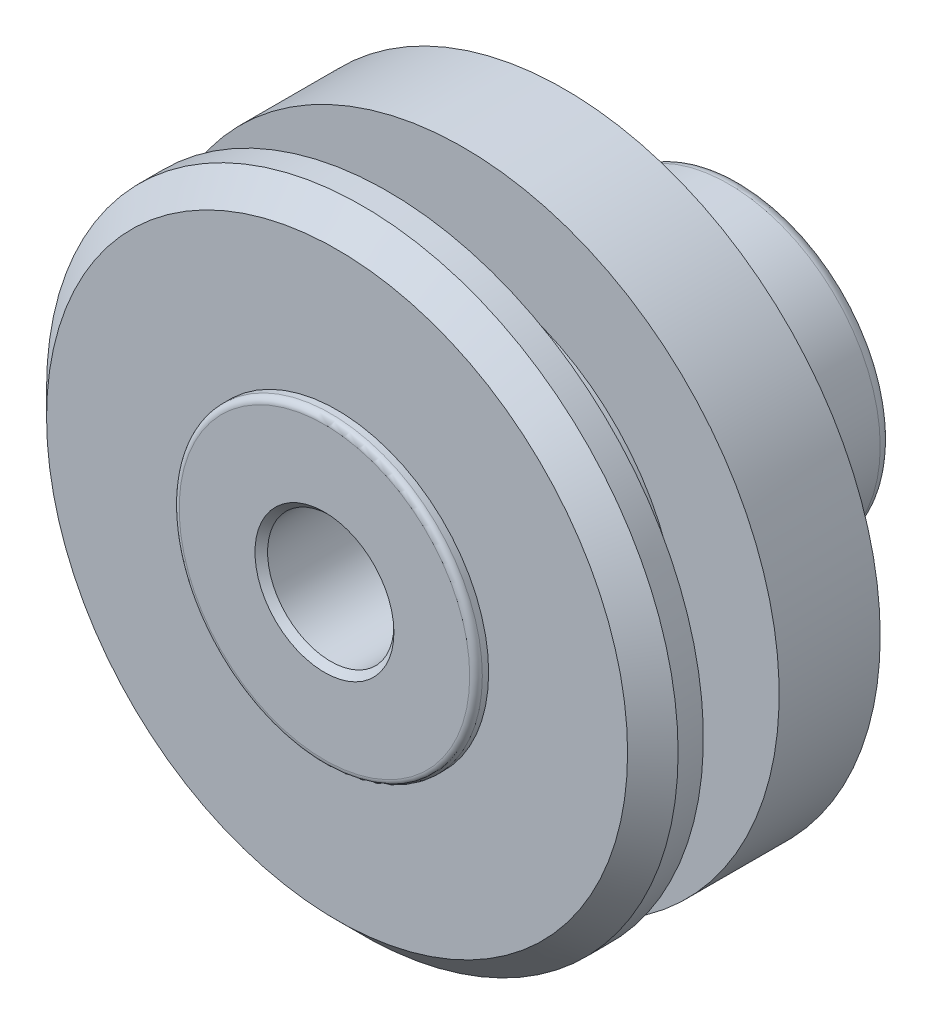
ISO-10303-21;
HEADER;
FILE_DESCRIPTION(('STEP AP214'),'2;1');
FILE_NAME('part.step','',(''),(''),'','','');
FILE_SCHEMA(('AUTOMOTIVE_DESIGN { 1 0 10303 214 1 1 1 1 }'));
ENDSEC;
DATA;
#1=APPLICATION_CONTEXT('core data for automotive mechanical design processes');
#2=APPLICATION_PROTOCOL_DEFINITION('international standard','automotive_design',2000,#1);
#3=PRODUCT_CONTEXT('',#1,'mechanical');
#4=PRODUCT('Part','Part','',(#3));
#5=PRODUCT_RELATED_PRODUCT_CATEGORY('part','',(#4));
#6=PRODUCT_DEFINITION_FORMATION('','',#4);
#7=PRODUCT_DEFINITION_CONTEXT('part definition',#1,'design');
#8=PRODUCT_DEFINITION('design','',#6,#7);
#9=PRODUCT_DEFINITION_SHAPE('','',#8);
#10=(LENGTH_UNIT() NAMED_UNIT(*) SI_UNIT(.MILLI.,.METRE.));
#11=(NAMED_UNIT(*) PLANE_ANGLE_UNIT() SI_UNIT($,.RADIAN.));
#12=(NAMED_UNIT(*) SI_UNIT($,.STERADIAN.) SOLID_ANGLE_UNIT());
#13=UNCERTAINTY_MEASURE_WITH_UNIT(LENGTH_MEASURE(1.E-05),#10,'distance_accuracy_value','');
#14=(GEOMETRIC_REPRESENTATION_CONTEXT(3) GLOBAL_UNCERTAINTY_ASSIGNED_CONTEXT((#13)) GLOBAL_UNIT_ASSIGNED_CONTEXT((#10,
#11,#12)) REPRESENTATION_CONTEXT('',''));
#15=CARTESIAN_POINT('',(0.,0.,0.));
#16=DIRECTION('',(0.,0.,1.));
#17=DIRECTION('',(1.,0.,0.));
#18=AXIS2_PLACEMENT_3D('',#15,#16,#17);
#19=CARTESIAN_POINT('',(0.,0.,9.00000000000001));
#20=DIRECTION('',(0.,0.,1.));
#21=DIRECTION('',(1.,0.,0.));
#22=AXIS2_PLACEMENT_3D('',#19,#20,#21);
#23=PLANE('',#22);
#24=CARTESIAN_POINT('',(0.,0.,9.00000000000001));
#25=DIRECTION('',(0.,0.,1.));
#26=DIRECTION('',(1.,0.,0.));
#27=AXIS2_PLACEMENT_3D('',#24,#25,#26);
#28=CIRCLE('',#27,11.5);
#29=CARTESIAN_POINT('',(11.5,0.,9.00000000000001));
#30=VERTEX_POINT('',#29);
#31=EDGE_CURVE('E55',#30,#30,#28,.T.);
#32=ORIENTED_EDGE('',*,*,#31,.T.);
#33=EDGE_LOOP('',(#32));
#34=FACE_BOUND('',#33,.T.);
#35=CARTESIAN_POINT('',(0.,0.,9.00000000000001));
#36=DIRECTION('',(0.,0.,1.));
#37=DIRECTION('',(1.,0.,0.));
#38=AXIS2_PLACEMENT_3D('',#35,#36,#37);
#39=CIRCLE('',#38,6.);
#40=CARTESIAN_POINT('',(6.,0.,9.00000000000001));
#41=VERTEX_POINT('',#40);
#42=EDGE_CURVE('E73',#41,#41,#39,.T.);
#43=ORIENTED_EDGE('',*,*,#42,.F.);
#44=EDGE_LOOP('',(#43));
#45=FACE_BOUND('',#44,.T.);
#46=ADVANCED_FACE('F26',(#34,#45),#23,.T.);
#47=CARTESIAN_POINT('',(0.,0.,9.00000000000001));
#48=DIRECTION('',(0.,0.,-1.));
#49=DIRECTION('',(-1.,0.,0.));
#50=AXIS2_PLACEMENT_3D('',#47,#48,#49);
#51=CYLINDRICAL_SURFACE('',#50,12.5);
#52=CARTESIAN_POINT('',(0.,0.,8.00000000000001));
#53=DIRECTION('',(0.,0.,1.));
#54=DIRECTION('',(1.,0.,0.));
#55=AXIS2_PLACEMENT_3D('',#52,#53,#54);
#56=CIRCLE('',#55,12.5);
#57=CARTESIAN_POINT('',(12.5,0.,8.00000000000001));
#58=VERTEX_POINT('',#57);
#59=EDGE_CURVE('E52',#58,#58,#56,.F.);
#60=ORIENTED_EDGE('',*,*,#59,.T.);
#61=EDGE_LOOP('',(#60));
#62=FACE_BOUND('',#61,.T.);
#63=CARTESIAN_POINT('',(0.,0.,7.00000000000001));
#64=DIRECTION('',(0.,0.,-1.));
#65=DIRECTION('',(-1.,0.,0.));
#66=AXIS2_PLACEMENT_3D('',#63,#64,#65);
#67=CIRCLE('',#66,12.5);
#68=CARTESIAN_POINT('',(-12.5,0.,7.00000000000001));
#69=VERTEX_POINT('',#68);
#70=EDGE_CURVE('E61',#69,#69,#67,.T.);
#71=ORIENTED_EDGE('',*,*,#70,.F.);
#72=EDGE_LOOP('',(#71));
#73=FACE_BOUND('',#72,.T.);
#74=ADVANCED_FACE('F28',(#62,#73),#51,.T.);
#75=CARTESIAN_POINT('',(0.,0.,9.00000000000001));
#76=DIRECTION('',(0.,0.,-1.));
#77=DIRECTION('',(-1.,0.,0.));
#78=AXIS2_PLACEMENT_3D('',#75,#76,#77);
#79=CONICAL_SURFACE('',#78,11.5,0.785398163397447);
#80=ORIENTED_EDGE('',*,*,#59,.F.);
#81=EDGE_LOOP('',(#80));
#82=FACE_BOUND('',#81,.T.);
#83=ORIENTED_EDGE('',*,*,#31,.F.);
#84=EDGE_LOOP('',(#83));
#85=FACE_BOUND('',#84,.T.);
#86=ADVANCED_FACE('F138',(#82,#85),#79,.T.);
#87=CARTESIAN_POINT('',(12.5,0.,7.00000000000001));
#88=DIRECTION('',(0.,0.,-1.));
#89=DIRECTION('',(-1.,0.,0.));
#90=AXIS2_PLACEMENT_3D('',#87,#88,#89);
#91=PLANE('',#90);
#92=ORIENTED_EDGE('',*,*,#70,.T.);
#93=EDGE_LOOP('',(#92));
#94=FACE_BOUND('',#93,.T.);
#95=CARTESIAN_POINT('',(0.,0.,7.00000000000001));
#96=DIRECTION('',(0.,0.,-1.));
#97=DIRECTION('',(-1.,0.,0.));
#98=AXIS2_PLACEMENT_3D('',#95,#96,#97);
#99=CIRCLE('',#98,8.5);
#100=CARTESIAN_POINT('',(-8.5,0.,7.00000000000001));
#101=VERTEX_POINT('',#100);
#102=EDGE_CURVE('E64',#101,#101,#99,.T.);
#103=ORIENTED_EDGE('',*,*,#102,.F.);
#104=EDGE_LOOP('',(#103));
#105=FACE_BOUND('',#104,.T.);
#106=ADVANCED_FACE('F150',(#94,#105),#91,.T.);
#107=CARTESIAN_POINT('',(0.,0.,-4.45904436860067));
#108=DIRECTION('',(0.,0.,-1.));
#109=DIRECTION('',(-1.,0.,0.));
#110=AXIS2_PLACEMENT_3D('',#107,#108,#109);
#111=CYLINDRICAL_SURFACE('',#110,8.5);
#112=ORIENTED_EDGE('',*,*,#102,.T.);
#113=EDGE_LOOP('',(#112));
#114=FACE_BOUND('',#113,.T.);
#115=CARTESIAN_POINT('',(0.,0.,4.));
#116=DIRECTION('',(0.,0.,-1.));
#117=DIRECTION('',(-1.,0.,0.));
#118=AXIS2_PLACEMENT_3D('',#115,#116,#117);
#119=CIRCLE('',#118,8.5);
#120=CARTESIAN_POINT('',(-8.5,0.,4.));
#121=VERTEX_POINT('',#120);
#122=EDGE_CURVE('E67',#121,#121,#119,.T.);
#123=ORIENTED_EDGE('',*,*,#122,.F.);
#124=EDGE_LOOP('',(#123));
#125=FACE_BOUND('',#124,.T.);
#126=ADVANCED_FACE('F154',(#114,#125),#111,.T.);
#127=CARTESIAN_POINT('',(12.5,0.,4.));
#128=DIRECTION('',(0.,0.,1.));
#129=DIRECTION('',(1.,0.,0.));
#130=AXIS2_PLACEMENT_3D('',#127,#128,#129);
#131=PLANE('',#130);
#132=ORIENTED_EDGE('',*,*,#122,.T.);
#133=EDGE_LOOP('',(#132));
#134=FACE_BOUND('',#133,.T.);
#135=CARTESIAN_POINT('',(0.,0.,4.));
#136=DIRECTION('',(0.,0.,-1.));
#137=DIRECTION('',(-1.,0.,0.));
#138=AXIS2_PLACEMENT_3D('',#135,#136,#137);
#139=CIRCLE('',#138,12.5);
#140=CARTESIAN_POINT('',(-12.5,0.,4.));
#141=VERTEX_POINT('',#140);
#142=EDGE_CURVE('E70',#141,#141,#139,.T.);
#143=ORIENTED_EDGE('',*,*,#142,.F.);
#144=EDGE_LOOP('',(#143));
#145=FACE_BOUND('',#144,.T.);
#146=ADVANCED_FACE('F146',(#134,#145),#131,.T.);
#147=CARTESIAN_POINT('',(0.,0.,0.));
#148=DIRECTION('',(0.,0.,1.));
#149=DIRECTION('',(1.,0.,0.));
#150=AXIS2_PLACEMENT_3D('',#147,#148,#149);
#151=PLANE('',#150);
#152=CARTESIAN_POINT('',(0.,0.,0.));
#153=DIRECTION('',(0.,0.,-1.));
#154=DIRECTION('',(-1.,0.,0.));
#155=AXIS2_PLACEMENT_3D('',#152,#153,#154);
#156=CIRCLE('',#155,9.5);
#157=CARTESIAN_POINT('',(-9.5,0.,0.));
#158=VERTEX_POINT('',#157);
#159=EDGE_CURVE('E82',#158,#158,#156,.T.);
#160=ORIENTED_EDGE('',*,*,#159,.F.);
#161=EDGE_LOOP('',(#160));
#162=FACE_BOUND('',#161,.T.);
#163=CARTESIAN_POINT('',(0.,0.,0.));
#164=DIRECTION('',(0.,0.,1.));
#165=DIRECTION('',(1.,0.,0.));
#166=AXIS2_PLACEMENT_3D('',#163,#164,#165);
#167=CIRCLE('',#166,12.5);
#168=CARTESIAN_POINT('',(12.5,0.,0.));
#169=VERTEX_POINT('',#168);
#170=EDGE_CURVE('E58',#169,#169,#167,.T.);
#171=ORIENTED_EDGE('',*,*,#170,.F.);
#172=EDGE_LOOP('',(#171));
#173=FACE_BOUND('',#172,.T.);
#174=ADVANCED_FACE('F143',(#162,#173),#151,.F.);
#175=ORIENTED_EDGE('',*,*,#170,.T.);
#176=EDGE_LOOP('',(#175));
#177=FACE_BOUND('',#176,.T.);
#178=ORIENTED_EDGE('',*,*,#142,.T.);
#179=EDGE_LOOP('',(#178));
#180=FACE_BOUND('',#179,.T.);
#181=ADVANCED_FACE('F140',(#177,#180),#51,.T.);
#182=CARTESIAN_POINT('',(0.,0.,9.50000000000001));
#183=DIRECTION('',(0.,0.,-1.));
#184=DIRECTION('',(-1.,0.,0.));
#185=AXIS2_PLACEMENT_3D('',#182,#183,#184);
#186=CYLINDRICAL_SURFACE('',#185,6.);
#187=CARTESIAN_POINT('',(0.,0.,9.25000000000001));
#188=DIRECTION('',(0.,0.,1.));
#189=DIRECTION('',(1.,0.,0.));
#190=AXIS2_PLACEMENT_3D('',#187,#188,#189);
#191=CIRCLE('',#190,6.);
#192=CARTESIAN_POINT('',(6.,0.,9.25000000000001));
#193=VERTEX_POINT('',#192);
#194=EDGE_CURVE('E46',#193,#193,#191,.F.);
#195=ORIENTED_EDGE('',*,*,#194,.T.);
#196=EDGE_LOOP('',(#195));
#197=FACE_BOUND('',#196,.T.);
#198=ORIENTED_EDGE('',*,*,#42,.T.);
#199=EDGE_LOOP('',(#198));
#200=FACE_BOUND('',#199,.T.);
#201=ADVANCED_FACE('F162',(#197,#200),#186,.T.);
#202=CARTESIAN_POINT('',(0.,0.,9.50000000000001));
#203=DIRECTION('',(0.,0.,1.));
#204=DIRECTION('',(1.,0.,0.));
#205=AXIS2_PLACEMENT_3D('',#202,#203,#204);
#206=PLANE('',#205);
#207=CARTESIAN_POINT('',(0.,0.,9.50000000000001));
#208=DIRECTION('',(0.,0.,1.));
#209=DIRECTION('',(1.,0.,0.));
#210=AXIS2_PLACEMENT_3D('',#207,#208,#209);
#211=CIRCLE('',#210,2.75);
#212=CARTESIAN_POINT('',(2.75,0.,9.50000000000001));
#213=VERTEX_POINT('',#212);
#214=EDGE_CURVE('E10',#213,#213,#211,.F.);
#215=ORIENTED_EDGE('',*,*,#214,.T.);
#216=EDGE_LOOP('',(#215));
#217=FACE_BOUND('',#216,.T.);
#218=CARTESIAN_POINT('',(0.,0.,9.50000000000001));
#219=DIRECTION('',(0.,0.,1.));
#220=DIRECTION('',(1.,0.,0.));
#221=AXIS2_PLACEMENT_3D('',#218,#219,#220);
#222=CIRCLE('',#221,5.75);
#223=CARTESIAN_POINT('',(5.75,0.,9.50000000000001));
#224=VERTEX_POINT('',#223);
#225=EDGE_CURVE('E49',#224,#224,#222,.T.);
#226=ORIENTED_EDGE('',*,*,#225,.T.);
#227=EDGE_LOOP('',(#226));
#228=FACE_BOUND('',#227,.T.);
#229=ADVANCED_FACE('F165',(#217,#228),#206,.T.);
#230=CARTESIAN_POINT('',(0.,0.,9.25000000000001));
#231=DIRECTION('',(0.,0.,1.));
#232=DIRECTION('',(1.,0.,0.));
#233=AXIS2_PLACEMENT_3D('',#230,#231,#232);
#234=TOROIDAL_SURFACE('',#233,5.75,0.25);
#235=ORIENTED_EDGE('',*,*,#194,.F.);
#236=EDGE_LOOP('',(#235));
#237=FACE_BOUND('',#236,.T.);
#238=ORIENTED_EDGE('',*,*,#225,.F.);
#239=EDGE_LOOP('',(#238));
#240=FACE_BOUND('',#239,.T.);
#241=ADVANCED_FACE('F169',(#237,#240),#234,.T.);
#242=CARTESIAN_POINT('',(0.,0.,2.5));
#243=DIRECTION('',(0.,0.,1.));
#244=DIRECTION('',(1.,0.,0.));
#245=AXIS2_PLACEMENT_3D('',#242,#243,#244);
#246=CYLINDRICAL_SURFACE('',#245,2.5);
#247=CARTESIAN_POINT('',(0.,0.,9.25000000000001));
#248=DIRECTION('',(0.,0.,1.));
#249=DIRECTION('',(1.,0.,0.));
#250=AXIS2_PLACEMENT_3D('',#247,#248,#249);
#251=CIRCLE('',#250,2.5);
#252=CARTESIAN_POINT('',(2.5,0.,9.25000000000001));
#253=VERTEX_POINT('',#252);
#254=EDGE_CURVE('E34',#253,#253,#251,.T.);
#255=ORIENTED_EDGE('',*,*,#254,.T.);
#256=EDGE_LOOP('',(#255));
#257=FACE_BOUND('',#256,.T.);
#258=CARTESIAN_POINT('',(0.,0.,2.5));
#259=DIRECTION('',(0.,0.,1.));
#260=DIRECTION('',(1.,0.,0.));
#261=AXIS2_PLACEMENT_3D('',#258,#259,#260);
#262=CIRCLE('',#261,2.5);
#263=CARTESIAN_POINT('',(2.5,0.,2.5));
#264=VERTEX_POINT('',#263);
#265=EDGE_CURVE('E76',#264,#264,#262,.T.);
#266=ORIENTED_EDGE('',*,*,#265,.F.);
#267=EDGE_LOOP('',(#266));
#268=FACE_BOUND('',#267,.T.);
#269=ADVANCED_FACE('F172',(#257,#268),#246,.F.);
#270=CARTESIAN_POINT('',(0.,0.,2.5));
#271=DIRECTION('',(0.,0.,1.));
#272=DIRECTION('',(1.,0.,0.));
#273=AXIS2_PLACEMENT_3D('',#270,#271,#272);
#274=PLANE('',#273);
#275=CARTESIAN_POINT('',(0.,0.,2.5));
#276=DIRECTION('',(0.,0.,1.));
#277=DIRECTION('',(1.,0.,0.));
#278=AXIS2_PLACEMENT_3D('',#275,#276,#277);
#279=CIRCLE('',#278,1.5);
#280=CARTESIAN_POINT('',(1.5,0.,2.5));
#281=VERTEX_POINT('',#280);
#282=EDGE_CURVE('E94',#281,#281,#279,.T.);
#283=ORIENTED_EDGE('',*,*,#282,.F.);
#284=EDGE_LOOP('',(#283));
#285=FACE_BOUND('',#284,.T.);
#286=ORIENTED_EDGE('',*,*,#265,.T.);
#287=EDGE_LOOP('',(#286));
#288=FACE_BOUND('',#287,.T.);
#289=ADVANCED_FACE('F176',(#285,#288),#274,.T.);
#290=CARTESIAN_POINT('',(0.,0.,2.5));
#291=DIRECTION('',(0.,0.,-1.));
#292=DIRECTION('',(-1.,0.,0.));
#293=AXIS2_PLACEMENT_3D('',#290,#291,#292);
#294=CYLINDRICAL_SURFACE('',#293,9.5);
#295=CARTESIAN_POINT('',(0.,0.,2.5));
#296=DIRECTION('',(0.,0.,-1.));
#297=DIRECTION('',(-1.,0.,0.));
#298=AXIS2_PLACEMENT_3D('',#295,#296,#297);
#299=CIRCLE('',#298,9.5);
#300=CARTESIAN_POINT('',(-9.5,0.,2.5));
#301=VERTEX_POINT('',#300);
#302=EDGE_CURVE('E79',#301,#301,#299,.T.);
#303=ORIENTED_EDGE('',*,*,#302,.F.);
#304=EDGE_LOOP('',(#303));
#305=FACE_BOUND('',#304,.T.);
#306=ORIENTED_EDGE('',*,*,#159,.T.);
#307=EDGE_LOOP('',(#306));
#308=FACE_BOUND('',#307,.T.);
#309=ADVANCED_FACE('F180',(#305,#308),#294,.F.);
#310=CARTESIAN_POINT('',(0.,0.,2.5));
#311=DIRECTION('',(0.,0.,-1.));
#312=DIRECTION('',(-1.,0.,0.));
#313=AXIS2_PLACEMENT_3D('',#310,#311,#312);
#314=PLANE('',#313);
#315=CARTESIAN_POINT('',(0.,0.,2.5));
#316=DIRECTION('',(0.,0.,-1.));
#317=DIRECTION('',(-1.,0.,0.));
#318=AXIS2_PLACEMENT_3D('',#315,#316,#317);
#319=CIRCLE('',#318,6.);
#320=CARTESIAN_POINT('',(-6.,0.,2.5));
#321=VERTEX_POINT('',#320);
#322=EDGE_CURVE('E85',#321,#321,#319,.T.);
#323=ORIENTED_EDGE('',*,*,#322,.F.);
#324=EDGE_LOOP('',(#323));
#325=FACE_BOUND('',#324,.T.);
#326=ORIENTED_EDGE('',*,*,#302,.T.);
#327=EDGE_LOOP('',(#326));
#328=FACE_BOUND('',#327,.T.);
#329=ADVANCED_FACE('F184',(#325,#328),#314,.T.);
#330=CARTESIAN_POINT('',(0.,0.,2.5));
#331=DIRECTION('',(0.,0.,-1.));
#332=DIRECTION('',(-1.,0.,0.));
#333=AXIS2_PLACEMENT_3D('',#330,#331,#332);
#334=CYLINDRICAL_SURFACE('',#333,6.);
#335=CARTESIAN_POINT('',(0.,0.,-6.50000000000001));
#336=DIRECTION('',(0.,0.,-1.));
#337=DIRECTION('',(-1.,0.,0.));
#338=AXIS2_PLACEMENT_3D('',#335,#336,#337);
#339=CIRCLE('',#338,6.);
#340=CARTESIAN_POINT('',(-6.,0.,-6.50000000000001));
#341=VERTEX_POINT('',#340);
#342=EDGE_CURVE('E38',#341,#341,#339,.F.);
#343=ORIENTED_EDGE('',*,*,#342,.T.);
#344=EDGE_LOOP('',(#343));
#345=FACE_BOUND('',#344,.T.);
#346=ORIENTED_EDGE('',*,*,#322,.T.);
#347=EDGE_LOOP('',(#346));
#348=FACE_BOUND('',#347,.T.);
#349=ADVANCED_FACE('F120',(#345,#348),#334,.T.);
#350=CARTESIAN_POINT('',(0.,0.,-7.00000000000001));
#351=DIRECTION('',(0.,0.,-1.));
#352=DIRECTION('',(-1.,0.,0.));
#353=AXIS2_PLACEMENT_3D('',#350,#351,#352);
#354=PLANE('',#353);
#355=CARTESIAN_POINT('',(0.,0.,-7.00000000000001));
#356=DIRECTION('',(0.,0.,-1.));
#357=DIRECTION('',(-1.,0.,0.));
#358=AXIS2_PLACEMENT_3D('',#355,#356,#357);
#359=CIRCLE('',#358,3.);
#360=CARTESIAN_POINT('',(-3.,0.,-7.00000000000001));
#361=VERTEX_POINT('',#360);
#362=EDGE_CURVE('E91',#361,#361,#359,.T.);
#363=ORIENTED_EDGE('',*,*,#362,.F.);
#364=EDGE_LOOP('',(#363));
#365=FACE_BOUND('',#364,.T.);
#366=CARTESIAN_POINT('',(0.,0.,-7.00000000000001));
#367=DIRECTION('',(0.,0.,-1.));
#368=DIRECTION('',(-1.,0.,0.));
#369=AXIS2_PLACEMENT_3D('',#366,#367,#368);
#370=CIRCLE('',#369,5.5);
#371=CARTESIAN_POINT('',(-5.5,0.,-7.00000000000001));
#372=VERTEX_POINT('',#371);
#373=EDGE_CURVE('E43',#372,#372,#370,.T.);
#374=ORIENTED_EDGE('',*,*,#373,.T.);
#375=EDGE_LOOP('',(#374));
#376=FACE_BOUND('',#375,.T.);
#377=ADVANCED_FACE('F116',(#365,#376),#354,.T.);
#378=CARTESIAN_POINT('',(0.,0.,-6.50000000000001));
#379=DIRECTION('',(0.,0.,-1.));
#380=DIRECTION('',(-1.,0.,0.));
#381=AXIS2_PLACEMENT_3D('',#378,#379,#380);
#382=TOROIDAL_SURFACE('',#381,5.5,0.5);
#383=ORIENTED_EDGE('',*,*,#342,.F.);
#384=EDGE_LOOP('',(#383));
#385=FACE_BOUND('',#384,.T.);
#386=ORIENTED_EDGE('',*,*,#373,.F.);
#387=EDGE_LOOP('',(#386));
#388=FACE_BOUND('',#387,.T.);
#389=ADVANCED_FACE('F119',(#385,#388),#382,.T.);
#390=CARTESIAN_POINT('',(0.,0.,9.25000000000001));
#391=DIRECTION('',(0.,0.,1.));
#392=DIRECTION('',(1.,0.,0.));
#393=AXIS2_PLACEMENT_3D('',#390,#391,#392);
#394=CONICAL_SURFACE('',#393,2.5,0.785398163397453);
#395=ORIENTED_EDGE('',*,*,#214,.F.);
#396=EDGE_LOOP('',(#395));
#397=FACE_BOUND('',#396,.T.);
#398=ORIENTED_EDGE('',*,*,#254,.F.);
#399=EDGE_LOOP('',(#398));
#400=FACE_BOUND('',#399,.T.);
#401=ADVANCED_FACE('F112',(#397,#400),#394,.F.);
#402=CARTESIAN_POINT('',(0.,0.,-0.5));
#403=DIRECTION('',(0.,0.,-1.));
#404=DIRECTION('',(-1.,0.,0.));
#405=AXIS2_PLACEMENT_3D('',#402,#403,#404);
#406=CYLINDRICAL_SURFACE('',#405,3.);
#407=CARTESIAN_POINT('',(0.,0.,-0.5));
#408=DIRECTION('',(0.,0.,-1.));
#409=DIRECTION('',(-1.,0.,0.));
#410=AXIS2_PLACEMENT_3D('',#407,#408,#409);
#411=CIRCLE('',#410,3.);
#412=CARTESIAN_POINT('',(-3.,0.,-0.5));
#413=VERTEX_POINT('',#412);
#414=EDGE_CURVE('E88',#413,#413,#411,.T.);
#415=CARTESIAN_POINT('',(-3.,0.,-0.5));
#416=CARTESIAN_POINT('',(-3.,0.,-0.567708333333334));
#417=CARTESIAN_POINT('',(-3.,0.,-0.635416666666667));
#418=CARTESIAN_POINT('',(-3.,0.,-0.770833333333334));
#419=CARTESIAN_POINT('',(-3.,0.,-0.838541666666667));
#420=CARTESIAN_POINT('',(-3.,0.,-0.973958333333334));
#421=CARTESIAN_POINT('',(-3.,0.,-1.04166666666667));
#422=CARTESIAN_POINT('',(-3.,0.,-1.17708333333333));
#423=CARTESIAN_POINT('',(-3.,0.,-1.24479166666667));
#424=CARTESIAN_POINT('',(-3.,0.,-1.38020833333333));
#425=CARTESIAN_POINT('',(-3.,0.,-1.44791666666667));
#426=CARTESIAN_POINT('',(-3.,0.,-1.58333333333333));
#427=CARTESIAN_POINT('',(-3.,0.,-1.65104166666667));
#428=CARTESIAN_POINT('',(-3.,0.,-1.78645833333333));
#429=CARTESIAN_POINT('',(-3.,0.,-1.85416666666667));
#430=CARTESIAN_POINT('',(-3.,0.,-1.98958333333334));
#431=CARTESIAN_POINT('',(-3.,0.,-2.05729166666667));
#432=CARTESIAN_POINT('',(-3.,0.,-2.19270833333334));
#433=CARTESIAN_POINT('',(-3.,0.,-2.26041666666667));
#434=CARTESIAN_POINT('',(-3.,0.,-2.39583333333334));
#435=CARTESIAN_POINT('',(-3.,0.,-2.46354166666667));
#436=CARTESIAN_POINT('',(-3.,0.,-2.59895833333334));
#437=CARTESIAN_POINT('',(-3.,0.,-2.66666666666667));
#438=CARTESIAN_POINT('',(-3.,0.,-2.80208333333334));
#439=CARTESIAN_POINT('',(-3.,0.,-2.86979166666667));
#440=CARTESIAN_POINT('',(-3.,0.,-3.00520833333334));
#441=CARTESIAN_POINT('',(-3.,0.,-3.07291666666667));
#442=CARTESIAN_POINT('',(-3.,0.,-3.20833333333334));
#443=CARTESIAN_POINT('',(-3.,0.,-3.27604166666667));
#444=CARTESIAN_POINT('',(-3.,0.,-3.41145833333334));
#445=CARTESIAN_POINT('',(-3.,0.,-3.47916666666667));
#446=CARTESIAN_POINT('',(-3.,0.,-3.61458333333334));
#447=CARTESIAN_POINT('',(-3.,0.,-3.68229166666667));
#448=CARTESIAN_POINT('',(-3.,0.,-3.81770833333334));
#449=CARTESIAN_POINT('',(-3.,0.,-3.88541666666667));
#450=CARTESIAN_POINT('',(-3.,0.,-4.02083333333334));
#451=CARTESIAN_POINT('',(-3.,0.,-4.08854166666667));
#452=CARTESIAN_POINT('',(-3.,0.,-4.22395833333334));
#453=CARTESIAN_POINT('',(-3.,0.,-4.29166666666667));
#454=CARTESIAN_POINT('',(-3.,0.,-4.42708333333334));
#455=CARTESIAN_POINT('',(-3.,0.,-4.49479166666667));
#456=CARTESIAN_POINT('',(-3.,0.,-4.63020833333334));
#457=CARTESIAN_POINT('',(-3.,0.,-4.69791666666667));
#458=CARTESIAN_POINT('',(-3.,0.,-4.83333333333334));
#459=CARTESIAN_POINT('',(-3.,0.,-4.90104166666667));
#460=CARTESIAN_POINT('',(-3.,0.,-5.03645833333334));
#461=CARTESIAN_POINT('',(-3.,0.,-5.10416666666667));
#462=CARTESIAN_POINT('',(-3.,0.,-5.23958333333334));
#463=CARTESIAN_POINT('',(-3.,0.,-5.30729166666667));
#464=CARTESIAN_POINT('',(-3.,0.,-5.44270833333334));
#465=CARTESIAN_POINT('',(-3.,0.,-5.51041666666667));
#466=CARTESIAN_POINT('',(-3.,0.,-5.64583333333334));
#467=CARTESIAN_POINT('',(-3.,0.,-5.71354166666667));
#468=CARTESIAN_POINT('',(-3.,0.,-5.84895833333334));
#469=CARTESIAN_POINT('',(-3.,0.,-5.91666666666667));
#470=CARTESIAN_POINT('',(-3.,0.,-6.05208333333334));
#471=CARTESIAN_POINT('',(-3.,0.,-6.11979166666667));
#472=CARTESIAN_POINT('',(-3.,0.,-6.25520833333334));
#473=CARTESIAN_POINT('',(-3.,0.,-6.32291666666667));
#474=CARTESIAN_POINT('',(-3.,0.,-6.45833333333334));
#475=CARTESIAN_POINT('',(-3.,0.,-6.52604166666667));
#476=CARTESIAN_POINT('',(-3.,0.,-6.66145833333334));
#477=CARTESIAN_POINT('',(-3.,0.,-6.72916666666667));
#478=CARTESIAN_POINT('',(-3.,0.,-6.86458333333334));
#479=CARTESIAN_POINT('',(-3.,0.,-6.93229166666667));
#480=CARTESIAN_POINT('',(-3.,0.,-7.00000000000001));
#481=B_SPLINE_CURVE_WITH_KNOTS('',3,(#415,#416,#417,#418,#419,#420,#421,#422,#423,#424,#425,
#426,#427,#428,#429,#430,#431,#432,#433,#434,#435,#436,#437,#438,#439,#440,#441,#442,#443,#444,
#445,#446,#447,#448,#449,#450,#451,#452,#453,#454,#455,#456,#457,#458,#459,#460,#461,#462,#463,
#464,#465,#466,#467,#468,#469,#470,#471,#472,#473,#474,#475,#476,#477,#478,#479,#480),
.UNSPECIFIED.,.F.,.F.,(4,2,2,2,2,2,2,2,2,2,2,2,2,2,2,2,2,2,2,2,2,2,2,2,2,2,2,2,2,2,2,2,4),(0.,
0.203125,0.40625,0.609375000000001,0.812500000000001,1.015625,1.21875,1.421875,1.625,1.828125,
2.03125,2.234375,2.4375,2.640625,2.84375,3.046875,3.25,3.453125,3.65625,3.859375,4.0625,
4.265625,4.46875,4.671875,4.875,5.078125,5.28125,5.484375,5.6875,5.890625,6.09375,6.296875,
6.50000000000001),.UNSPECIFIED.);
#482=EDGE_CURVE('BSEAM106',#413,#361,#481,.T.);
#483=ORIENTED_EDGE('',*,*,#414,.F.);
#484=ORIENTED_EDGE('',*,*,#362,.T.);
#485=ORIENTED_EDGE('',*,*,#482,.T.);
#486=ORIENTED_EDGE('',*,*,#482,.F.);
#487=EDGE_LOOP('',(#483,#485,#484,#486));
#488=FACE_BOUND('',#487,.T.);
#489=ADVANCED_FACE('F106',(#488),#406,.F.);
#490=CARTESIAN_POINT('',(0.,0.,-0.5));
#491=DIRECTION('',(0.,0.,-1.));
#492=DIRECTION('',(-1.,0.,0.));
#493=AXIS2_PLACEMENT_3D('',#490,#491,#492);
#494=PLANE('',#493);
#495=CARTESIAN_POINT('',(0.,0.,-0.5));
#496=DIRECTION('',(0.,0.,-1.));
#497=DIRECTION('',(-1.,0.,0.));
#498=AXIS2_PLACEMENT_3D('',#495,#496,#497);
#499=CIRCLE('',#498,1.5);
#500=CARTESIAN_POINT('',(-1.5,0.,-0.5));
#501=VERTEX_POINT('',#500);
#502=EDGE_CURVE('E30',#501,#501,#499,.T.);
#503=ORIENTED_EDGE('',*,*,#502,.F.);
#504=EDGE_LOOP('',(#503));
#505=FACE_BOUND('',#504,.T.);
#506=ORIENTED_EDGE('',*,*,#414,.T.);
#507=EDGE_LOOP('',(#506));
#508=FACE_BOUND('',#507,.T.);
#509=ADVANCED_FACE('F103',(#505,#508),#494,.T.);
#510=CARTESIAN_POINT('',(0.,0.,-7.00000000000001));
#511=DIRECTION('',(0.,0.,1.));
#512=DIRECTION('',(1.,0.,0.));
#513=AXIS2_PLACEMENT_3D('',#510,#511,#512);
#514=CYLINDRICAL_SURFACE('',#513,1.5);
#515=ORIENTED_EDGE('',*,*,#502,.T.);
#516=EDGE_LOOP('',(#515));
#517=FACE_BOUND('',#516,.T.);
#518=ORIENTED_EDGE('',*,*,#282,.T.);
#519=EDGE_LOOP('',(#518));
#520=FACE_BOUND('',#519,.T.);
#521=ADVANCED_FACE('F101',(#517,#520),#514,.F.);
#522=CLOSED_SHELL('',(#46,#74,#86,#106,#126,#146,#174,#181,#201,#229,#241,#269,#289,#309,#329,
#349,#377,#389,#401,#489,#509,#521));
#523=MANIFOLD_SOLID_BREP('B2',#522);
#524=ADVANCED_BREP_SHAPE_REPRESENTATION('',(#18,#523),#14);
#525=SHAPE_DEFINITION_REPRESENTATION(#9,#524);
ENDSEC;
END-ISO-10303-21;
